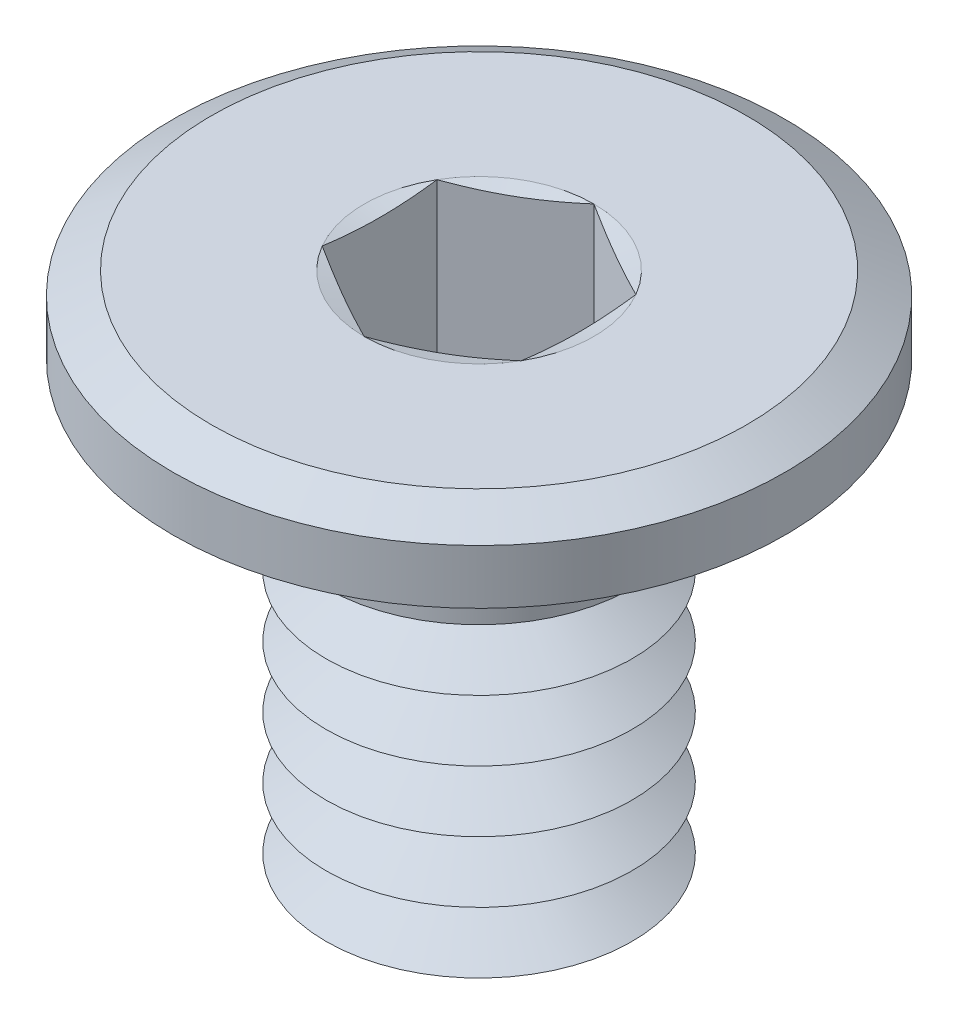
from build123d import *

# Parameters (mm, degrees)
SKETCH1_R           = 2
BOSS_EXTRUDE1_DEPTH = 0.5
SKETCH2_R           = 1
BOSS_EXTRUDE2_DEPTH = 3
LPATTERN1_COUNT     = 6
LPATTERN1_PITCH     = 0.4
FILLET1_R           = 0.1
CHAMFER2_SIZE       = 0.25
CHAMFER2_SIZE2      = 0.144337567
CUT_EXTRUDE1_DEPTH  = 1.2


with BuildPart() as part:
    # Sketch1 → Boss-Extrude1 (new body)
    with BuildSketch(Plane(origin=(0, 0, 0), x_dir=(1, 0, 0), z_dir=(0, 1, 0))):
        with Locations(Location((0, 0, 0), (0, 0, 270))):
            Circle(SKETCH1_R)
    extrude(amount=-BOSS_EXTRUDE1_DEPTH)

    # Sketch2 → Boss-Extrude2 (add)
    with BuildSketch(Plane.XZ.offset(0.5)):
        with Locations(Location((0, 0, 0), (0, 0, 270))):
            Circle(SKETCH2_R)
    extrude(amount=BOSS_EXTRUDE2_DEPTH)

    # Sketch5 → Cut-Revolve1 (revolve, cut)
    with BuildSketch(Plane(origin=(0, 0, 0), x_dir=(0, 0, -1), z_dir=(1, 0, 0))):
        Polygon((-1, -3.7), (-0.653589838, -3.5), (-1, -3.3), align=None)
    cut_revolve1 = revolve(axis=Axis((0, 0.990593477, 0), (0, -1, 0)), mode=Mode.SUBTRACT)

    # LPattern1: Cut-Revolve1 ×6
    with Locations(*[(0, i * LPATTERN1_PITCH, 0) for i in range(1, LPATTERN1_COUNT)]):
        add(cut_revolve1, mode=Mode.SUBTRACT)

    # Fillet1
    fillet1_edges = [part.edges().sort_by_distance(p)[0] for p in [
        (0, -0.5, 1),
    ]]
    fillet(fillet1_edges, radius=FILLET1_R)

    # Chamfer2
    chamfer2_edges = [part.edges().sort_by_distance(p)[0] for p in [
        (0, 0, -2),
    ]]
    chamfer2_side = [part.faces().sort_by_distance(p)[0] for p in [
        (0, 0, 0),
    ]]
    chamfer(chamfer2_edges, length=CHAMFER2_SIZE, length2=CHAMFER2_SIZE2, reference=chamfer2_side[0])

    # Sketch6 → Cut-Extrude1 (cut)
    with BuildSketch(Plane(origin=(0, 0, 0), x_dir=(1, 0, 0), z_dir=(0, 1, 0))):
        Polygon((0, 0.75055535), (-0.65, 0.375277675), (-0.65, -0.375277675), (0, -0.75055535), (0.65, -0.375277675), (0.65, 0.375277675), align=None)
    extrude(amount=-CUT_EXTRUDE1_DEPTH, mode=Mode.SUBTRACT)

    # Cut-Extrude2 cone 1 section (on through the dimple's axis) → Cut-Extrude2 (revolve, cut)
    with BuildSketch(Plane(origin=(0, -1.2, 0), x_dir=(0, 0, 1), z_dir=(1, 0, 0))):
        Polygon((0, 0), (0.65, 0), (0, 0.375277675), align=None)
    revolve(axis=Axis((0, -1.2, 0), (0, -1, 0)), mode=Mode.SUBTRACT)

    # Cut-Extrude3 cone 1 section (on through the dimple's axis) → Cut-Extrude3 (revolve, cut)
    with BuildSketch(Plane(origin=(0, 0, 0), x_dir=(0, 0, 1), z_dir=(1, 0, 0))):
        Polygon((0, 0), (0.75055535, 0), (0, 0.2011107), align=None)
    revolve(axis=Axis((0, 0, 0), (0, -1, 0)), mode=Mode.SUBTRACT)


solid = part.part
